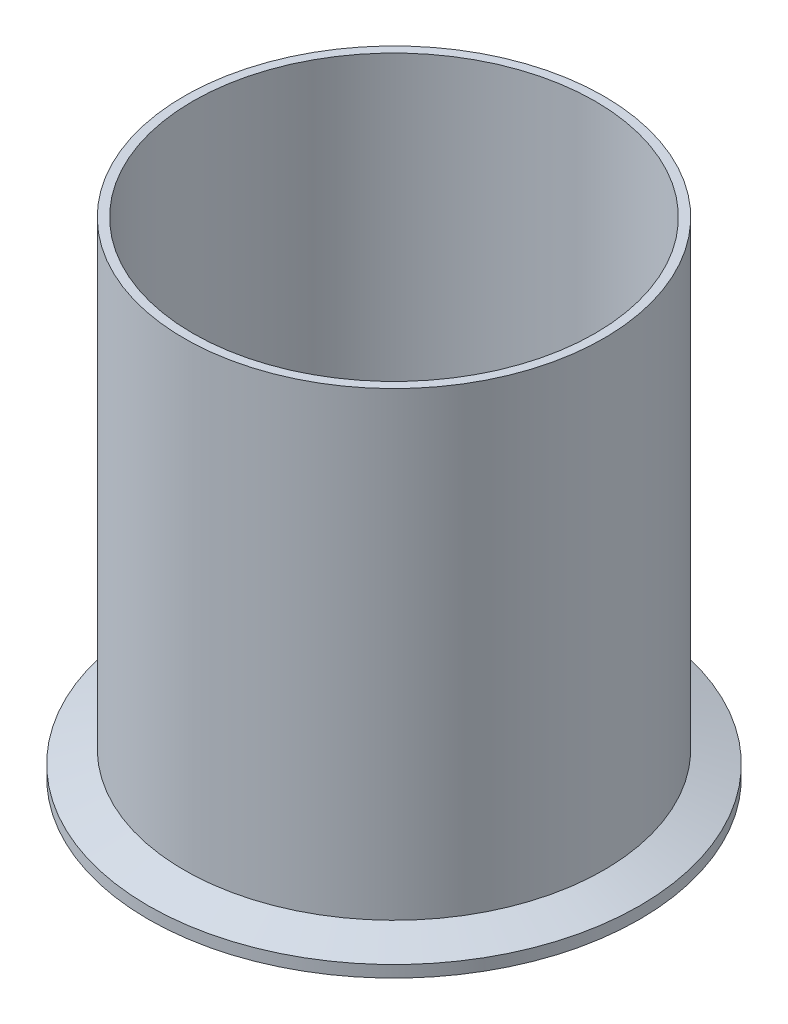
ISO-10303-21;
HEADER;
FILE_DESCRIPTION(('STEP AP214'),'2;1');
FILE_NAME('part.step','',(''),(''),'','','');
FILE_SCHEMA(('AUTOMOTIVE_DESIGN { 1 0 10303 214 1 1 1 1 }'));
ENDSEC;
DATA;
#1=APPLICATION_CONTEXT('core data for automotive mechanical design processes');
#2=APPLICATION_PROTOCOL_DEFINITION('international standard','automotive_design',2000,#1);
#3=PRODUCT_CONTEXT('',#1,'mechanical');
#4=PRODUCT('Part','Part','',(#3));
#5=PRODUCT_RELATED_PRODUCT_CATEGORY('part','',(#4));
#6=PRODUCT_DEFINITION_FORMATION('','',#4);
#7=PRODUCT_DEFINITION_CONTEXT('part definition',#1,'design');
#8=PRODUCT_DEFINITION('design','',#6,#7);
#9=PRODUCT_DEFINITION_SHAPE('','',#8);
#10=(LENGTH_UNIT() NAMED_UNIT(*) SI_UNIT(.MILLI.,.METRE.));
#11=(NAMED_UNIT(*) PLANE_ANGLE_UNIT() SI_UNIT($,.RADIAN.));
#12=(NAMED_UNIT(*) SI_UNIT($,.STERADIAN.) SOLID_ANGLE_UNIT());
#13=UNCERTAINTY_MEASURE_WITH_UNIT(LENGTH_MEASURE(1.E-05),#10,'distance_accuracy_value','');
#14=(GEOMETRIC_REPRESENTATION_CONTEXT(3) GLOBAL_UNCERTAINTY_ASSIGNED_CONTEXT((#13)) GLOBAL_UNIT_ASSIGNED_CONTEXT((#10,
#11,#12)) REPRESENTATION_CONTEXT('',''));
#15=CARTESIAN_POINT('',(0.,0.,0.));
#16=DIRECTION('',(0.,0.,1.));
#17=DIRECTION('',(1.,0.,0.));
#18=AXIS2_PLACEMENT_3D('',#15,#16,#17);
#19=CARTESIAN_POINT('',(0.,0.7874,0.));
#20=DIRECTION('',(0.,-1.,0.));
#21=DIRECTION('',(0.,0.,-1.));
#22=AXIS2_PLACEMENT_3D('',#19,#20,#21);
#23=TOROIDAL_SURFACE('',#22,56.6185084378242,0.787400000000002);
#24=CARTESIAN_POINT('',(0.,0.,0.));
#25=DIRECTION('',(0.,-1.,0.));
#26=DIRECTION('',(0.,0.,-1.));
#27=AXIS2_PLACEMENT_3D('',#24,#25,#26);
#28=CIRCLE('',#27,56.6185084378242);
#29=CARTESIAN_POINT('',(0.,0.,-56.6185084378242));
#30=VERTEX_POINT('',#29);
#31=EDGE_CURVE('E67',#30,#30,#28,.T.);
#32=ORIENTED_EDGE('',*,*,#31,.T.);
#33=EDGE_LOOP('',(#32));
#34=FACE_BOUND('',#33,.T.);
#35=CARTESIAN_POINT('',(0.,0.474458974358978,0.));
#36=DIRECTION('',(0.,-1.,0.));
#37=DIRECTION('',(0.,0.,-1.));
#38=AXIS2_PLACEMENT_3D('',#35,#36,#37);
#39=CIRCLE('',#38,55.8959666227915);
#40=CARTESIAN_POINT('',(0.,0.474458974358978,-55.8959666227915));
#41=VERTEX_POINT('',#40);
#42=EDGE_CURVE('E10',#41,#41,#39,.T.);
#43=ORIENTED_EDGE('',*,*,#42,.F.);
#44=EDGE_LOOP('',(#43));
#45=FACE_BOUND('',#44,.T.);
#46=ADVANCED_FACE('F33',(#34,#45),#23,.T.);
#47=CARTESIAN_POINT('',(0.,0.,0.));
#48=DIRECTION('',(0.,-1.,0.));
#49=DIRECTION('',(0.,0.,-1.));
#50=AXIS2_PLACEMENT_3D('',#47,#48,#49);
#51=TOROIDAL_SURFACE('',#50,54.8005,1.1938);
#52=CARTESIAN_POINT('',(0.,0.474458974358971,0.));
#53=DIRECTION('',(0.,-1.,0.));
#54=DIRECTION('',(0.,0.,-1.));
#55=AXIS2_PLACEMENT_3D('',#52,#53,#54);
#56=CIRCLE('',#55,53.7050333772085);
#57=CARTESIAN_POINT('',(0.,0.474458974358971,-53.7050333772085));
#58=VERTEX_POINT('',#57);
#59=EDGE_CURVE('E39',#58,#58,#56,.T.);
#60=ORIENTED_EDGE('',*,*,#59,.F.);
#61=EDGE_LOOP('',(#60));
#62=FACE_BOUND('',#61,.T.);
#63=ORIENTED_EDGE('',*,*,#42,.T.);
#64=EDGE_LOOP('',(#63));
#65=FACE_BOUND('',#64,.T.);
#66=ADVANCED_FACE('F115',(#62,#65),#51,.F.);
#67=CARTESIAN_POINT('',(0.,0.7874,0.));
#68=DIRECTION('',(0.,-1.,0.));
#69=DIRECTION('',(0.,0.,-1.));
#70=AXIS2_PLACEMENT_3D('',#67,#68,#69);
#71=TOROIDAL_SURFACE('',#70,52.9824915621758,0.787399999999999);
#72=ORIENTED_EDGE('',*,*,#59,.T.);
#73=EDGE_LOOP('',(#72));
#74=FACE_BOUND('',#73,.T.);
#75=CARTESIAN_POINT('',(0.,0.,0.));
#76=DIRECTION('',(0.,-1.,0.));
#77=DIRECTION('',(0.,0.,-1.));
#78=AXIS2_PLACEMENT_3D('',#75,#76,#77);
#79=CIRCLE('',#78,52.9824915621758);
#80=CARTESIAN_POINT('',(0.,0.,-52.9824915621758));
#81=VERTEX_POINT('',#80);
#82=EDGE_CURVE('E43',#81,#81,#79,.T.);
#83=ORIENTED_EDGE('',*,*,#82,.F.);
#84=EDGE_LOOP('',(#83));
#85=FACE_BOUND('',#84,.T.);
#86=ADVANCED_FACE('F111',(#74,#85),#71,.T.);
#87=CARTESIAN_POINT('',(0.,0.,0.));
#88=DIRECTION('',(0.,1.,0.));
#89=DIRECTION('',(0.,0.,1.));
#90=AXIS2_PLACEMENT_3D('',#87,#88,#89);
#91=PLANE('',#90);
#92=CARTESIAN_POINT('',(0.,0.,0.));
#93=DIRECTION('',(0.,-1.,0.));
#94=DIRECTION('',(0.,0.,-1.));
#95=AXIS2_PLACEMENT_3D('',#92,#93,#94);
#96=CIRCLE('',#95,48.6918);
#97=CARTESIAN_POINT('',(0.,0.,-48.6918));
#98=VERTEX_POINT('',#97);
#99=EDGE_CURVE('E47',#98,#98,#96,.T.);
#100=ORIENTED_EDGE('',*,*,#99,.F.);
#101=EDGE_LOOP('',(#100));
#102=FACE_BOUND('',#101,.T.);
#103=ORIENTED_EDGE('',*,*,#82,.T.);
#104=EDGE_LOOP('',(#103));
#105=FACE_BOUND('',#104,.T.);
#106=ADVANCED_FACE('F105',(#102,#105),#91,.F.);
#107=CARTESIAN_POINT('',(0.,0.,0.));
#108=DIRECTION('',(0.,-1.,0.));
#109=DIRECTION('',(0.,0.,-1.));
#110=AXIS2_PLACEMENT_3D('',#107,#108,#109);
#111=CYLINDRICAL_SURFACE('',#110,48.6918);
#112=ORIENTED_EDGE('',*,*,#99,.T.);
#113=EDGE_LOOP('',(#112));
#114=FACE_BOUND('',#113,.T.);
#115=CARTESIAN_POINT('',(0.,117.475,0.));
#116=DIRECTION('',(0.,-1.,0.));
#117=DIRECTION('',(0.,0.,-1.));
#118=AXIS2_PLACEMENT_3D('',#115,#116,#117);
#119=CIRCLE('',#118,48.6918);
#120=CARTESIAN_POINT('',(0.,117.475,-48.6918));
#121=VERTEX_POINT('',#120);
#122=EDGE_CURVE('E52',#121,#121,#119,.T.);
#123=ORIENTED_EDGE('',*,*,#122,.F.);
#124=EDGE_LOOP('',(#123));
#125=FACE_BOUND('',#124,.T.);
#126=ADVANCED_FACE('F100',(#114,#125),#111,.F.);
#127=CARTESIAN_POINT('',(0.,117.475,0.));
#128=DIRECTION('',(0.,-1.,0.));
#129=DIRECTION('',(0.,0.,-1.));
#130=AXIS2_PLACEMENT_3D('',#127,#128,#129);
#131=PLANE('',#130);
#132=CARTESIAN_POINT('',(0.,117.475,0.));
#133=DIRECTION('',(0.,-1.,0.));
#134=DIRECTION('',(0.,0.,-1.));
#135=AXIS2_PLACEMENT_3D('',#132,#133,#134);
#136=CIRCLE('',#135,50.8);
#137=CARTESIAN_POINT('',(0.,117.475,-50.8));
#138=VERTEX_POINT('',#137);
#139=EDGE_CURVE('E55',#138,#138,#136,.T.);
#140=ORIENTED_EDGE('',*,*,#139,.F.);
#141=EDGE_LOOP('',(#140));
#142=FACE_BOUND('',#141,.T.);
#143=ORIENTED_EDGE('',*,*,#122,.T.);
#144=EDGE_LOOP('',(#143));
#145=FACE_BOUND('',#144,.T.);
#146=ADVANCED_FACE('F94',(#142,#145),#131,.F.);
#147=CARTESIAN_POINT('',(0.,0.,0.));
#148=DIRECTION('',(0.,-1.,0.));
#149=DIRECTION('',(0.,0.,-1.));
#150=AXIS2_PLACEMENT_3D('',#147,#148,#149);
#151=CYLINDRICAL_SURFACE('',#150,50.8);
#152=CARTESIAN_POINT('',(0.,5.99729178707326,0.));
#153=DIRECTION('',(0.,-1.,0.));
#154=DIRECTION('',(0.,0.,-1.));
#155=AXIS2_PLACEMENT_3D('',#152,#153,#154);
#156=CIRCLE('',#155,50.8);
#157=CARTESIAN_POINT('',(0.,5.99729178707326,-50.8));
#158=VERTEX_POINT('',#157);
#159=EDGE_CURVE('E58',#158,#158,#156,.T.);
#160=ORIENTED_EDGE('',*,*,#159,.F.);
#161=EDGE_LOOP('',(#160));
#162=FACE_BOUND('',#161,.T.);
#163=ORIENTED_EDGE('',*,*,#139,.T.);
#164=EDGE_LOOP('',(#163));
#165=FACE_BOUND('',#164,.T.);
#166=ADVANCED_FACE('F88',(#162,#165),#151,.T.);
#167=CARTESIAN_POINT('',(0.,5.99729178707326,0.));
#168=DIRECTION('',(0.,-1.,0.));
#169=DIRECTION('',(0.,0.,-1.));
#170=AXIS2_PLACEMENT_3D('',#167,#168,#169);
#171=CONICAL_SURFACE('',#170,50.8,1.22173047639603);
#172=CARTESIAN_POINT('',(0.,2.8448,0.));
#173=DIRECTION('',(0.,-1.,0.));
#174=DIRECTION('',(0.,0.,-1.));
#175=AXIS2_PLACEMENT_3D('',#172,#173,#174);
#176=CIRCLE('',#175,59.4614);
#177=CARTESIAN_POINT('',(0.,2.8448,-59.4614));
#178=VERTEX_POINT('',#177);
#179=EDGE_CURVE('E61',#178,#178,#176,.T.);
#180=ORIENTED_EDGE('',*,*,#179,.F.);
#181=EDGE_LOOP('',(#180));
#182=FACE_BOUND('',#181,.T.);
#183=ORIENTED_EDGE('',*,*,#159,.T.);
#184=EDGE_LOOP('',(#183));
#185=FACE_BOUND('',#184,.T.);
#186=ADVANCED_FACE('F82',(#182,#185),#171,.T.);
#187=CARTESIAN_POINT('',(0.,0.,0.));
#188=DIRECTION('',(0.,-1.,0.));
#189=DIRECTION('',(0.,0.,-1.));
#190=AXIS2_PLACEMENT_3D('',#187,#188,#189);
#191=CYLINDRICAL_SURFACE('',#190,59.4614);
#192=CARTESIAN_POINT('',(0.,0.,0.));
#193=DIRECTION('',(0.,-1.,0.));
#194=DIRECTION('',(0.,0.,-1.));
#195=AXIS2_PLACEMENT_3D('',#192,#193,#194);
#196=CIRCLE('',#195,59.4614);
#197=CARTESIAN_POINT('',(0.,0.,-59.4614));
#198=VERTEX_POINT('',#197);
#199=EDGE_CURVE('E64',#198,#198,#196,.T.);
#200=ORIENTED_EDGE('',*,*,#199,.F.);
#201=EDGE_LOOP('',(#200));
#202=FACE_BOUND('',#201,.T.);
#203=ORIENTED_EDGE('',*,*,#179,.T.);
#204=EDGE_LOOP('',(#203));
#205=FACE_BOUND('',#204,.T.);
#206=ADVANCED_FACE('F76',(#202,#205),#191,.T.);
#207=CARTESIAN_POINT('',(0.,0.,0.));
#208=DIRECTION('',(0.,1.,0.));
#209=DIRECTION('',(0.,0.,1.));
#210=AXIS2_PLACEMENT_3D('',#207,#208,#209);
#211=PLANE('',#210);
#212=ORIENTED_EDGE('',*,*,#31,.F.);
#213=EDGE_LOOP('',(#212));
#214=FACE_BOUND('',#213,.T.);
#215=ORIENTED_EDGE('',*,*,#199,.T.);
#216=EDGE_LOOP('',(#215));
#217=FACE_BOUND('',#216,.T.);
#218=ADVANCED_FACE('F73',(#214,#217),#211,.F.);
#219=CLOSED_SHELL('',(#46,#66,#86,#106,#126,#146,#166,#186,#206,#218));
#220=MANIFOLD_SOLID_BREP('B2',#219);
#221=ADVANCED_BREP_SHAPE_REPRESENTATION('',(#18,#220),#14);
#222=SHAPE_DEFINITION_REPRESENTATION(#9,#221);
ENDSEC;
END-ISO-10303-21;
